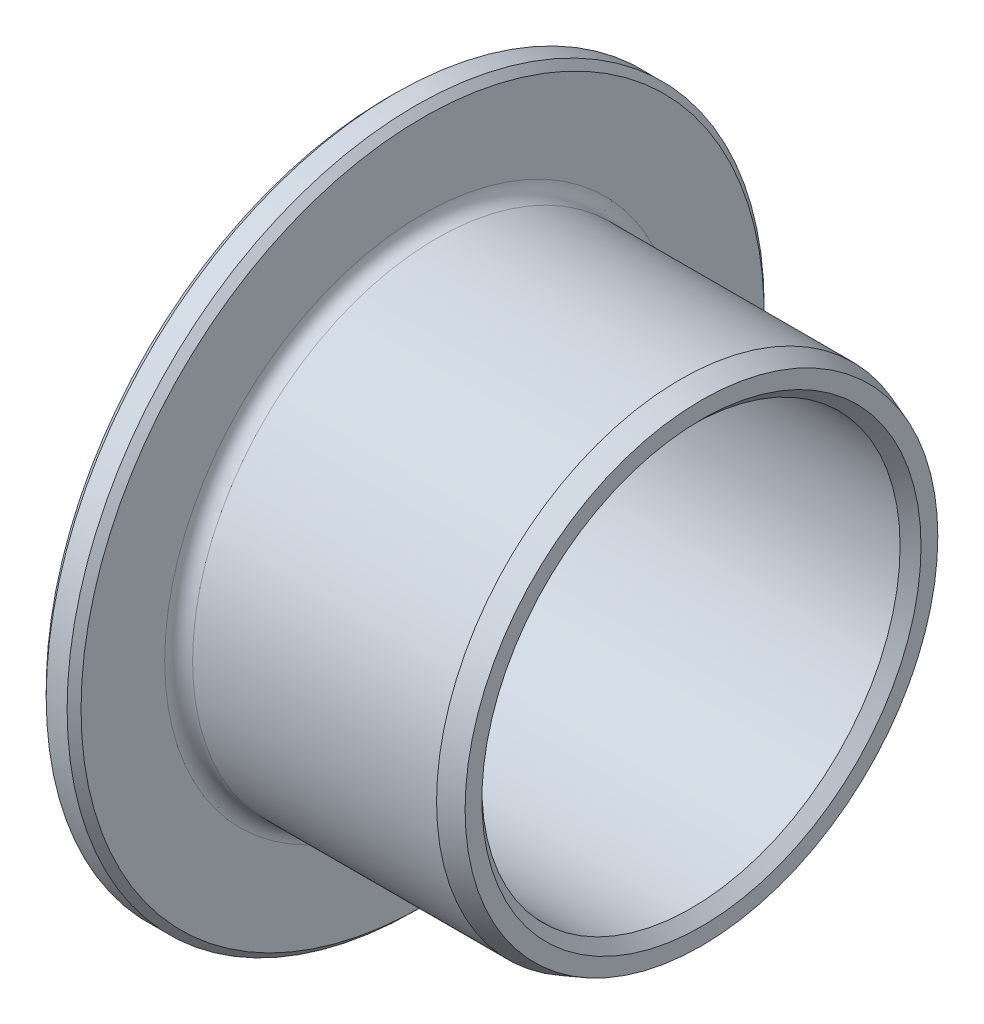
from build123d import *

# Parameters (mm, degrees)
CHANFREIN2_SIZE  = 0.6
CHANFREIN2_SIZE2 = 0.218382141
CHANFREIN3_SIZE  = 0.3
CHANFREIN4_SIZE  = 0.2
CONG_1_R         = 0.4


with BuildPart() as part:
    # Esquisse1 → Base-R_volution (revolve)
    with BuildSketch(Plane.XY, mode=Mode.PRIVATE) as base_r_volution_sk:
        Polygon((-1, 6), (-1, 10), (0, 10), (0, 7), (8, 7), (8, 6), align=None)
    revolve(base_r_volution_sk.sketch.rotate(Axis((-5.312682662, 0, 0), (1, 0, 0)), 90), axis=Axis((-5.312682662, 0, 0), (1, 0, 0)))

    # Chanfrein2
    chanfrein2_edges = [part.edges().sort_by_distance(p)[0] for p in [
        (8, 0, -7),
    ]]
    chanfrein2_side = [part.faces().sort_by_distance(p)[0] for p in [
        (4, 0, -7),
    ]]
    chamfer(chanfrein2_edges, length=CHANFREIN2_SIZE, length2=CHANFREIN2_SIZE2, reference=chanfrein2_side[0])

    # Chanfrein3
    chanfrein3_edges = [part.edges().sort_by_distance(p)[0] for p in [
        (-1, 0, -6),
        (8, 0, -6),
    ]]
    chamfer(chanfrein3_edges, length=CHANFREIN3_SIZE)

    # Chanfrein4
    chanfrein4_edges = [part.edges().sort_by_distance(p)[0] for p in [
        (0, 0, -10),
        (-1, 0, -10),
    ]]
    chamfer(chanfrein4_edges, length=CHANFREIN4_SIZE)

    # Cong_1
    cong_1_edges = [part.edges().sort_by_distance(p)[0] for p in [
        (0, 0, -7),
    ]]
    fillet(cong_1_edges, radius=CONG_1_R)


solid = part.part
